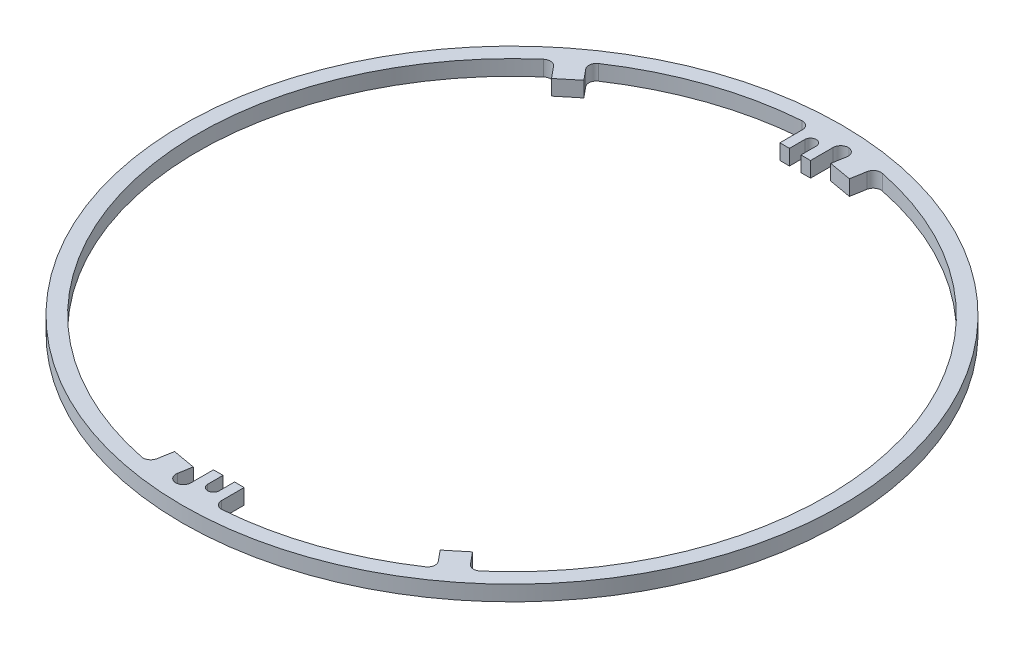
ISO-10303-21;
HEADER;
FILE_DESCRIPTION(('STEP AP214'),'2;1');
FILE_NAME('part.step','',(''),(''),'','','');
FILE_SCHEMA(('AUTOMOTIVE_DESIGN { 1 0 10303 214 1 1 1 1 }'));
ENDSEC;
DATA;
#1=APPLICATION_CONTEXT('core data for automotive mechanical design processes');
#2=APPLICATION_PROTOCOL_DEFINITION('international standard','automotive_design',2000,#1);
#3=PRODUCT_CONTEXT('',#1,'mechanical');
#4=PRODUCT('Part','Part','',(#3));
#5=PRODUCT_RELATED_PRODUCT_CATEGORY('part','',(#4));
#6=PRODUCT_DEFINITION_FORMATION('','',#4);
#7=PRODUCT_DEFINITION_CONTEXT('part definition',#1,'design');
#8=PRODUCT_DEFINITION('design','',#6,#7);
#9=PRODUCT_DEFINITION_SHAPE('','',#8);
#10=(LENGTH_UNIT() NAMED_UNIT(*) SI_UNIT(.MILLI.,.METRE.));
#11=(NAMED_UNIT(*) PLANE_ANGLE_UNIT() SI_UNIT($,.RADIAN.));
#12=(NAMED_UNIT(*) SI_UNIT($,.STERADIAN.) SOLID_ANGLE_UNIT());
#13=UNCERTAINTY_MEASURE_WITH_UNIT(LENGTH_MEASURE(1.E-05),#10,'distance_accuracy_value','');
#14=(GEOMETRIC_REPRESENTATION_CONTEXT(3) GLOBAL_UNCERTAINTY_ASSIGNED_CONTEXT((#13)) GLOBAL_UNIT_ASSIGNED_CONTEXT((#10,
#11,#12)) REPRESENTATION_CONTEXT('',''));
#15=CARTESIAN_POINT('',(0.,0.,0.));
#16=DIRECTION('',(0.,0.,1.));
#17=DIRECTION('',(1.,0.,0.));
#18=AXIS2_PLACEMENT_3D('',#15,#16,#17);
#19=CARTESIAN_POINT('',(0.,2.,0.));
#20=DIRECTION('',(0.,-1.,0.));
#21=DIRECTION('',(0.,0.,-1.));
#22=AXIS2_PLACEMENT_3D('',#19,#20,#21);
#23=CYLINDRICAL_SURFACE('',#22,41.);
#24=CARTESIAN_POINT('',(0.,2.,0.));
#25=DIRECTION('',(0.,1.,0.));
#26=DIRECTION('',(0.,0.,1.));
#27=AXIS2_PLACEMENT_3D('',#24,#25,#26);
#28=CIRCLE('',#27,41.);
#29=CARTESIAN_POINT('',(-3.075,2.,-40.8845248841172));
#30=VERTEX_POINT('',#29);
#31=CARTESIAN_POINT('',(-22.7848225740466,2.,-34.0859481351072));
#32=VERTEX_POINT('',#31);
#33=EDGE_CURVE('E491',#30,#32,#28,.T.);
#34=ORIENTED_EDGE('',*,*,#33,.T.);
#35=DIRECTION('',(0.,-1.,0.));
#36=VECTOR('',#35,1.);
#37=CARTESIAN_POINT('',(-22.7848225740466,2.,-34.0859481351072));
#38=LINE('',#37,#36);
#39=CARTESIAN_POINT('',(-22.7848225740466,0.,-34.0859481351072));
#40=VERTEX_POINT('',#39);
#41=EDGE_CURVE('E592',#32,#40,#38,.T.);
#42=ORIENTED_EDGE('',*,*,#41,.T.);
#43=CARTESIAN_POINT('',(0.,0.,0.));
#44=DIRECTION('',(0.,1.,0.));
#45=DIRECTION('',(0.,0.,1.));
#46=AXIS2_PLACEMENT_3D('',#43,#44,#45);
#47=CIRCLE('',#46,41.);
#48=CARTESIAN_POINT('',(-3.075,0.,-40.8845248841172));
#49=VERTEX_POINT('',#48);
#50=EDGE_CURVE('E497',#49,#40,#47,.T.);
#51=ORIENTED_EDGE('',*,*,#50,.F.);
#52=DIRECTION('',(0.,-1.,0.));
#53=VECTOR('',#52,1.);
#54=CARTESIAN_POINT('',(-3.075,2.,-40.8845248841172));
#55=LINE('',#54,#53);
#56=EDGE_CURVE('E509',#49,#30,#55,.F.);
#57=ORIENTED_EDGE('',*,*,#56,.T.);
#58=EDGE_LOOP('',(#34,#42,#51,#57));
#59=FACE_BOUND('',#58,.T.);
#60=ADVANCED_FACE('F36',(#59),#23,.F.);
#61=CARTESIAN_POINT('',(3.075,2.,40.8845248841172));
#62=VERTEX_POINT('',#61);
#63=CARTESIAN_POINT('',(22.7848225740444,2.,34.0859481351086));
#64=VERTEX_POINT('',#63);
#65=EDGE_CURVE('E486',#62,#64,#28,.T.);
#66=ORIENTED_EDGE('',*,*,#65,.T.);
#67=DIRECTION('',(0.,-1.,0.));
#68=VECTOR('',#67,1.);
#69=CARTESIAN_POINT('',(22.7848225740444,2.,34.0859481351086));
#70=LINE('',#69,#68);
#71=CARTESIAN_POINT('',(22.7848225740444,0.,34.0859481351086));
#72=VERTEX_POINT('',#71);
#73=EDGE_CURVE('E596',#64,#72,#70,.T.);
#74=ORIENTED_EDGE('',*,*,#73,.T.);
#75=CARTESIAN_POINT('',(3.075,0.,40.8845248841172));
#76=VERTEX_POINT('',#75);
#77=EDGE_CURVE('E492',#76,#72,#47,.T.);
#78=ORIENTED_EDGE('',*,*,#77,.F.);
#79=DIRECTION('',(0.,-1.,0.));
#80=VECTOR('',#79,1.);
#81=CARTESIAN_POINT('',(3.075,2.,40.8845248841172));
#82=LINE('',#81,#80);
#83=EDGE_CURVE('E523',#76,#62,#82,.F.);
#84=ORIENTED_EDGE('',*,*,#83,.T.);
#85=EDGE_LOOP('',(#66,#74,#78,#84));
#86=FACE_BOUND('',#85,.T.);
#87=ADVANCED_FACE('F624',(#86),#23,.F.);
#88=CARTESIAN_POINT('',(26.8619712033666,0.,30.9747397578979));
#89=VERTEX_POINT('',#88);
#90=CARTESIAN_POINT('',(8.12677801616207,0.,-40.186508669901));
#91=VERTEX_POINT('',#90);
#92=EDGE_CURVE('E496',#89,#91,#47,.T.);
#93=ORIENTED_EDGE('',*,*,#92,.F.);
#94=DIRECTION('',(0.,-1.,0.));
#95=VECTOR('',#94,1.);
#96=CARTESIAN_POINT('',(26.8619712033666,2.,30.9747397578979));
#97=LINE('',#96,#95);
#98=CARTESIAN_POINT('',(26.8619712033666,2.,30.9747397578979));
#99=VERTEX_POINT('',#98);
#100=EDGE_CURVE('E57',#89,#99,#97,.F.);
#101=ORIENTED_EDGE('',*,*,#100,.T.);
#102=CARTESIAN_POINT('',(8.12677801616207,2.,-40.186508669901));
#103=VERTEX_POINT('',#102);
#104=EDGE_CURVE('E490',#99,#103,#28,.T.);
#105=ORIENTED_EDGE('',*,*,#104,.T.);
#106=DIRECTION('',(0.,-1.,0.));
#107=VECTOR('',#106,1.);
#108=CARTESIAN_POINT('',(8.12677801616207,2.,-40.186508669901));
#109=LINE('',#108,#107);
#110=EDGE_CURVE('E573',#103,#91,#109,.T.);
#111=ORIENTED_EDGE('',*,*,#110,.T.);
#112=EDGE_LOOP('',(#93,#101,#105,#111));
#113=FACE_BOUND('',#112,.T.);
#114=ADVANCED_FACE('F723',(#113),#23,.F.);
#115=CARTESIAN_POINT('',(-26.8619712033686,0.,-30.9747397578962));
#116=VERTEX_POINT('',#115);
#117=CARTESIAN_POINT('',(-8.12677801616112,0.,40.1865086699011));
#118=VERTEX_POINT('',#117);
#119=EDGE_CURVE('E469',#116,#118,#47,.T.);
#120=ORIENTED_EDGE('',*,*,#119,.F.);
#121=DIRECTION('',(0.,-1.,0.));
#122=VECTOR('',#121,1.);
#123=CARTESIAN_POINT('',(-26.8619712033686,2.,-30.9747397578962));
#124=LINE('',#123,#122);
#125=CARTESIAN_POINT('',(-26.8619712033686,2.,-30.9747397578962));
#126=VERTEX_POINT('',#125);
#127=EDGE_CURVE('E590',#116,#126,#124,.F.);
#128=ORIENTED_EDGE('',*,*,#127,.T.);
#129=CARTESIAN_POINT('',(-8.12677801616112,2.,40.1865086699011));
#130=VERTEX_POINT('',#129);
#131=EDGE_CURVE('E495',#126,#130,#28,.T.);
#132=ORIENTED_EDGE('',*,*,#131,.T.);
#133=DIRECTION('',(0.,-1.,0.));
#134=VECTOR('',#133,1.);
#135=CARTESIAN_POINT('',(-8.12677801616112,2.,40.1865086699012));
#136=LINE('',#135,#134);
#137=EDGE_CURVE('E558',#130,#118,#136,.T.);
#138=ORIENTED_EDGE('',*,*,#137,.T.);
#139=EDGE_LOOP('',(#120,#128,#132,#138));
#140=FACE_BOUND('',#139,.T.);
#141=ADVANCED_FACE('F648',(#140),#23,.F.);
#142=CARTESIAN_POINT('',(0.,-5.69147245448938,36.9511904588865));
#143=DIRECTION('',(0.,0.,1.));
#144=DIRECTION('',(1.,0.,0.));
#145=AXIS2_PLACEMENT_3D('',#142,#143,#144);
#146=PLANE('',#145);
#147=DIRECTION('',(1.,0.,0.));
#148=VECTOR('',#147,1.);
#149=CARTESIAN_POINT('',(0.,2.,36.9511904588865));
#150=LINE('',#149,#148);
#151=CARTESIAN_POINT('',(-2.,2.,36.9511904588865));
#152=VERTEX_POINT('',#151);
#153=CARTESIAN_POINT('',(-0.75,2.,36.9511904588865));
#154=VERTEX_POINT('',#153);
#155=EDGE_CURVE('E470',#152,#154,#150,.T.);
#156=ORIENTED_EDGE('',*,*,#155,.T.);
#157=DIRECTION('',(0.,-1.,0.));
#158=VECTOR('',#157,1.);
#159=CARTESIAN_POINT('',(-0.75,-5.69147245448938,36.9511904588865));
#160=LINE('',#159,#158);
#161=CARTESIAN_POINT('',(-0.75,0.,36.9511904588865));
#162=VERTEX_POINT('',#161);
#163=EDGE_CURVE('E550',#154,#162,#160,.T.);
#164=ORIENTED_EDGE('',*,*,#163,.T.);
#165=DIRECTION('',(-1.,0.,0.));
#166=VECTOR('',#165,1.);
#167=CARTESIAN_POINT('',(0.,0.,36.9511904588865));
#168=LINE('',#167,#166);
#169=CARTESIAN_POINT('',(-2.,0.,36.9511904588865));
#170=VERTEX_POINT('',#169);
#171=EDGE_CURVE('E464',#162,#170,#168,.T.);
#172=ORIENTED_EDGE('',*,*,#171,.T.);
#173=DIRECTION('',(0.,1.,0.));
#174=VECTOR('',#173,1.);
#175=CARTESIAN_POINT('',(-2.,-5.69147245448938,36.9511904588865));
#176=LINE('',#175,#174);
#177=EDGE_CURVE('E478',#170,#152,#176,.T.);
#178=ORIENTED_EDGE('',*,*,#177,.T.);
#179=EDGE_LOOP('',(#156,#164,#172,#178));
#180=FACE_BOUND('',#179,.T.);
#181=ADVANCED_FACE('F687',(#180),#146,.F.);
#182=CARTESIAN_POINT('',(0.,-5.69147245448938,-38.9511904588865));
#183=DIRECTION('',(0.,1.,0.));
#184=DIRECTION('',(0.,0.,1.));
#185=AXIS2_PLACEMENT_3D('',#182,#183,#184);
#186=CYLINDRICAL_SURFACE('',#185,0.750000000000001);
#187=DIRECTION('',(0.,1.,0.));
#188=VECTOR('',#187,1.);
#189=CARTESIAN_POINT('',(0.75,0.,-38.9511904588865));
#190=LINE('',#189,#188);
#191=CARTESIAN_POINT('',(0.75,0.,-38.9511904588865));
#192=VERTEX_POINT('',#191);
#193=CARTESIAN_POINT('',(0.75,2.,-38.9511904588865));
#194=VERTEX_POINT('',#193);
#195=EDGE_CURVE('E406',#192,#194,#190,.T.);
#196=ORIENTED_EDGE('',*,*,#195,.T.);
#197=CARTESIAN_POINT('',(0.,2.,-38.9511904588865));
#198=DIRECTION('',(0.,1.,0.));
#199=DIRECTION('',(0.,0.,1.));
#200=AXIS2_PLACEMENT_3D('',#197,#198,#199);
#201=CIRCLE('',#200,0.750000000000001);
#202=CARTESIAN_POINT('',(-0.75,2.,-38.9511904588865));
#203=VERTEX_POINT('',#202);
#204=EDGE_CURVE('E409',#194,#203,#201,.T.);
#205=ORIENTED_EDGE('',*,*,#204,.T.);
#206=DIRECTION('',(0.,1.,0.));
#207=VECTOR('',#206,1.);
#208=CARTESIAN_POINT('',(-0.75,0.,-38.9511904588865));
#209=LINE('',#208,#207);
#210=CARTESIAN_POINT('',(-0.75,0.,-38.9511904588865));
#211=VERTEX_POINT('',#210);
#212=EDGE_CURVE('E401',#211,#203,#209,.T.);
#213=ORIENTED_EDGE('',*,*,#212,.F.);
#214=CARTESIAN_POINT('',(0.,0.,-38.9511904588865));
#215=DIRECTION('',(0.,1.,0.));
#216=DIRECTION('',(0.,0.,1.));
#217=AXIS2_PLACEMENT_3D('',#214,#215,#216);
#218=CIRCLE('',#217,0.750000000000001);
#219=EDGE_CURVE('E441',#211,#192,#218,.F.);
#220=ORIENTED_EDGE('',*,*,#219,.T.);
#221=EDGE_LOOP('',(#196,#205,#213,#220));
#222=FACE_BOUND('',#221,.T.);
#223=ADVANCED_FACE('F759',(#222),#186,.F.);
#224=CARTESIAN_POINT('',(0.,-5.69147245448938,-36.9511904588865));
#225=DIRECTION('',(0.,0.,1.));
#226=DIRECTION('',(1.,0.,0.));
#227=AXIS2_PLACEMENT_3D('',#224,#225,#226);
#228=PLANE('',#227);
#229=DIRECTION('',(0.,1.,0.));
#230=VECTOR('',#229,1.);
#231=CARTESIAN_POINT('',(0.75,-5.69147245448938,-36.9511904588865));
#232=LINE('',#231,#230);
#233=CARTESIAN_POINT('',(0.75,0.,-36.9511904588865));
#234=VERTEX_POINT('',#233);
#235=CARTESIAN_POINT('',(0.75,2.,-36.9511904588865));
#236=VERTEX_POINT('',#235);
#237=EDGE_CURVE('E545',#234,#236,#232,.T.);
#238=ORIENTED_EDGE('',*,*,#237,.F.);
#239=DIRECTION('',(-1.,0.,0.));
#240=VECTOR('',#239,1.);
#241=CARTESIAN_POINT('',(0.,0.,-36.9511904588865));
#242=LINE('',#241,#240);
#243=CARTESIAN_POINT('',(2.,0.,-36.9511904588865));
#244=VERTEX_POINT('',#243);
#245=EDGE_CURVE('E435',#244,#234,#242,.T.);
#246=ORIENTED_EDGE('',*,*,#245,.F.);
#247=DIRECTION('',(0.,1.,0.));
#248=VECTOR('',#247,1.);
#249=CARTESIAN_POINT('',(2.,-5.69147245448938,-36.9511904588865));
#250=LINE('',#249,#248);
#251=CARTESIAN_POINT('',(2.,2.,-36.9511904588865));
#252=VERTEX_POINT('',#251);
#253=EDGE_CURVE('E434',#244,#252,#250,.T.);
#254=ORIENTED_EDGE('',*,*,#253,.T.);
#255=DIRECTION('',(1.,0.,0.));
#256=VECTOR('',#255,1.);
#257=CARTESIAN_POINT('',(0.,2.,-36.9511904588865));
#258=LINE('',#257,#256);
#259=EDGE_CURVE('E452',#236,#252,#258,.T.);
#260=ORIENTED_EDGE('',*,*,#259,.F.);
#261=EDGE_LOOP('',(#238,#246,#254,#260));
#262=FACE_BOUND('',#261,.T.);
#263=ADVANCED_FACE('F766',(#262),#228,.T.);
#264=CARTESIAN_POINT('',(0.,2.,0.));
#265=DIRECTION('',(0.,1.,0.));
#266=DIRECTION('',(0.,0.,1.));
#267=AXIS2_PLACEMENT_3D('',#264,#265,#266);
#268=PLANE('',#267);
#269=DIRECTION('',(0.,0.,-1.));
#270=VECTOR('',#269,1.);
#271=CARTESIAN_POINT('',(0.75,2.,-35.9511904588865));
#272=LINE('',#271,#270);
#273=EDGE_CURVE('E398',#236,#194,#272,.T.);
#274=ORIENTED_EDGE('',*,*,#273,.F.);
#275=ORIENTED_EDGE('',*,*,#259,.T.);
#276=DIRECTION('',(0.,0.,1.));
#277=VECTOR('',#276,1.);
#278=CARTESIAN_POINT('',(1.99999999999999,2.,0.));
#279=LINE('',#278,#277);
#280=CARTESIAN_POINT('',(2.,2.,-39.8873413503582));
#281=VERTEX_POINT('',#280);
#282=EDGE_CURVE('E447',#281,#252,#279,.T.);
#283=ORIENTED_EDGE('',*,*,#282,.F.);
#284=CARTESIAN_POINT('',(3.,2.,-39.8873413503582));
#285=DIRECTION('',(0.,1.,0.));
#286=DIRECTION('',(0.,0.,1.));
#287=AXIS2_PLACEMENT_3D('',#284,#285,#286);
#288=CIRCLE('',#287,1.);
#289=CARTESIAN_POINT('',(3.075,2.,-40.8845248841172));
#290=VERTEX_POINT('',#289);
#291=EDGE_CURVE('E514',#281,#290,#288,.F.);
#292=ORIENTED_EDGE('',*,*,#291,.T.);
#293=CARTESIAN_POINT('',(2.97195013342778,2.,-39.8898486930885));
#294=DIRECTION('',(0.,1.,0.));
#295=DIRECTION('',(0.,0.,1.));
#296=AXIS2_PLACEMENT_3D('',#293,#294,#295);
#297=CIRCLE('',#296,1.);
#298=CARTESIAN_POINT('',(3.95675788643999,2.,-39.7162005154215));
#299=VERTEX_POINT('',#298);
#300=EDGE_CURVE('E583',#290,#299,#297,.F.);
#301=ORIENTED_EDGE('',*,*,#300,.T.);
#302=DIRECTION('',(-0.173648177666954,0.,0.984807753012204));
#303=VECTOR('',#302,1.);
#304=CARTESIAN_POINT('',(3.64420749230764,2.,-37.9436391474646));
#305=LINE('',#304,#303);
#306=CARTESIAN_POINT('',(3.64420749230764,2.,-37.9436391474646));
#307=VERTEX_POINT('',#306);
#308=EDGE_CURVE('E346',#299,#307,#305,.T.);
#309=ORIENTED_EDGE('',*,*,#308,.T.);
#310=DIRECTION('',(0.984807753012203,0.,0.173648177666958));
#311=VECTOR('',#310,1.);
#312=CARTESIAN_POINT('',(6.59863075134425,2.,-37.4226946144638));
#313=LINE('',#312,#311);
#314=CARTESIAN_POINT('',(6.59863075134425,2.,-37.4226946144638));
#315=VERTEX_POINT('',#314);
#316=EDGE_CURVE('E361',#307,#315,#313,.T.);
#317=ORIENTED_EDGE('',*,*,#316,.T.);
#318=DIRECTION('',(0.173648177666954,0.,-0.984807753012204));
#319=VECTOR('',#318,1.);
#320=CARTESIAN_POINT('',(7.11957528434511,2.,-40.3771178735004));
#321=LINE('',#320,#319);
#322=CARTESIAN_POINT('',(6.94375616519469,2.,-39.3799980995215));
#323=VERTEX_POINT('',#322);
#324=EDGE_CURVE('E364',#315,#323,#321,.T.);
#325=ORIENTED_EDGE('',*,*,#324,.T.);
#326=CARTESIAN_POINT('',(7.9285639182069,2.,-39.2063499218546));
#327=DIRECTION('',(0.,1.,0.));
#328=DIRECTION('',(0.,0.,1.));
#329=AXIS2_PLACEMENT_3D('',#326,#327,#328);
#330=CIRCLE('',#329,1.);
#331=EDGE_CURVE('E578',#323,#103,#330,.F.);
#332=ORIENTED_EDGE('',*,*,#331,.T.);
#333=ORIENTED_EDGE('',*,*,#104,.F.);
#334=CARTESIAN_POINT('',(26.2068011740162,2.,30.2192583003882));
#335=DIRECTION('',(0.,1.,0.));
#336=DIRECTION('',(0.,0.,1.));
#337=AXIS2_PLACEMENT_3D('',#334,#335,#336);
#338=CIRCLE('',#337,1.);
#339=CARTESIAN_POINT('',(25.4351765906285,2.,30.855336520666));
#340=VERTEX_POINT('',#339);
#341=EDGE_CURVE('E11',#99,#340,#338,.F.);
#342=ORIENTED_EDGE('',*,*,#341,.T.);
#343=DIRECTION('',(0.636078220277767,0.,0.771624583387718));
#344=VECTOR('',#343,1.);
#345=CARTESIAN_POINT('',(26.0792070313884,2.,31.6366079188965));
#346=LINE('',#345,#344);
#347=CARTESIAN_POINT('',(24.1709723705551,2.,29.3217341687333));
#348=VERTEX_POINT('',#347);
#349=EDGE_CURVE('E343',#348,#340,#346,.T.);
#350=ORIENTED_EDGE('',*,*,#349,.F.);
#351=DIRECTION('',(0.771624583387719,0.,-0.636078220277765));
#352=VECTOR('',#351,1.);
#353=CARTESIAN_POINT('',(24.1709723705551,2.,29.3217341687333));
#354=LINE('',#353,#352);
#355=CARTESIAN_POINT('',(21.8560986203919,2.,31.2299688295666));
#356=VERTEX_POINT('',#355);
#357=EDGE_CURVE('E348',#356,#348,#354,.T.);
#358=ORIENTED_EDGE('',*,*,#357,.F.);
#359=DIRECTION('',(-0.636078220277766,0.,-0.771624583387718));
#360=VECTOR('',#359,1.);
#361=CARTESIAN_POINT('',(21.8560986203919,2.,31.2299688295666));
#362=LINE('',#361,#360);
#363=CARTESIAN_POINT('',(23.0007197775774,2.,32.6185053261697));
#364=VERTEX_POINT('',#363);
#365=EDGE_CURVE('E335',#364,#356,#362,.T.);
#366=ORIENTED_EDGE('',*,*,#365,.F.);
#367=CARTESIAN_POINT('',(22.2290951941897,2.,33.2545835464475));
#368=DIRECTION('',(0.,1.,0.));
#369=DIRECTION('',(0.,0.,1.));
#370=AXIS2_PLACEMENT_3D('',#367,#368,#369);
#371=CIRCLE('',#370,1.);
#372=EDGE_CURVE('E615',#364,#64,#371,.F.);
#373=ORIENTED_EDGE('',*,*,#372,.T.);
#374=ORIENTED_EDGE('',*,*,#65,.F.);
#375=CARTESIAN_POINT('',(3.,2.,39.8873413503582));
#376=DIRECTION('',(0.,1.,0.));
#377=DIRECTION('',(0.,0.,1.));
#378=AXIS2_PLACEMENT_3D('',#375,#376,#377);
#379=CIRCLE('',#378,1.);
#380=CARTESIAN_POINT('',(2.,2.,39.8873413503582));
#381=VERTEX_POINT('',#380);
#382=EDGE_CURVE('E534',#62,#381,#379,.F.);
#383=ORIENTED_EDGE('',*,*,#382,.T.);
#384=DIRECTION('',(0.,0.,-1.));
#385=VECTOR('',#384,1.);
#386=CARTESIAN_POINT('',(1.99999999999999,2.,0.));
#387=LINE('',#386,#385);
#388=CARTESIAN_POINT('',(2.,2.,36.9511904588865));
#389=VERTEX_POINT('',#388);
#390=EDGE_CURVE('E475',#381,#389,#387,.T.);
#391=ORIENTED_EDGE('',*,*,#390,.T.);
#392=CARTESIAN_POINT('',(0.75,2.,36.9511904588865));
#393=VERTEX_POINT('',#392);
#394=EDGE_CURVE('E444',#393,#389,#150,.T.);
#395=ORIENTED_EDGE('',*,*,#394,.F.);
#396=DIRECTION('',(0.,0.,-1.));
#397=VECTOR('',#396,1.);
#398=CARTESIAN_POINT('',(0.75,2.,35.9511904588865));
#399=LINE('',#398,#397);
#400=CARTESIAN_POINT('',(0.75,2.,38.9511904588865));
#401=VERTEX_POINT('',#400);
#402=EDGE_CURVE('E424',#401,#393,#399,.T.);
#403=ORIENTED_EDGE('',*,*,#402,.F.);
#404=CARTESIAN_POINT('',(0.,2.,38.9511904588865));
#405=DIRECTION('',(0.,1.,0.));
#406=DIRECTION('',(0.,0.,-1.));
#407=AXIS2_PLACEMENT_3D('',#404,#405,#406);
#408=CIRCLE('',#407,0.75);
#409=CARTESIAN_POINT('',(-0.75,2.,38.9511904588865));
#410=VERTEX_POINT('',#409);
#411=EDGE_CURVE('E393',#410,#401,#408,.T.);
#412=ORIENTED_EDGE('',*,*,#411,.F.);
#413=DIRECTION('',(0.,0.,1.));
#414=VECTOR('',#413,1.);
#415=CARTESIAN_POINT('',(-0.75,2.,38.9511904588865));
#416=LINE('',#415,#414);
#417=EDGE_CURVE('E415',#154,#410,#416,.T.);
#418=ORIENTED_EDGE('',*,*,#417,.F.);
#419=ORIENTED_EDGE('',*,*,#155,.F.);
#420=DIRECTION('',(0.,0.,-1.));
#421=VECTOR('',#420,1.);
#422=CARTESIAN_POINT('',(-1.99999999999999,2.,0.));
#423=LINE('',#422,#421);
#424=CARTESIAN_POINT('',(-2.,2.,39.8873413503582));
#425=VERTEX_POINT('',#424);
#426=EDGE_CURVE('E473',#425,#152,#423,.T.);
#427=ORIENTED_EDGE('',*,*,#426,.F.);
#428=CARTESIAN_POINT('',(-3.,2.,39.8873413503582));
#429=DIRECTION('',(0.,1.,0.));
#430=DIRECTION('',(0.,0.,1.));
#431=AXIS2_PLACEMENT_3D('',#428,#429,#430);
#432=CIRCLE('',#431,1.);
#433=CARTESIAN_POINT('',(-3.075,2.,40.8845248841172));
#434=VERTEX_POINT('',#433);
#435=EDGE_CURVE('E538',#425,#434,#432,.F.);
#436=ORIENTED_EDGE('',*,*,#435,.T.);
#437=CARTESIAN_POINT('',(-2.97195013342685,2.,39.8898486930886));
#438=DIRECTION('',(0.,1.,0.));
#439=DIRECTION('',(0.,0.,1.));
#440=AXIS2_PLACEMENT_3D('',#437,#438,#439);
#441=CIRCLE('',#440,1.);
#442=CARTESIAN_POINT('',(-3.95675788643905,2.,39.7162005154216));
#443=VERTEX_POINT('',#442);
#444=EDGE_CURVE('E561',#434,#443,#441,.F.);
#445=ORIENTED_EDGE('',*,*,#444,.T.);
#446=DIRECTION('',(0.17364817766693,0.,-0.984807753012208));
#447=VECTOR('',#446,1.);
#448=CARTESIAN_POINT('',(-3.64420749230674,2.,37.9436391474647));
#449=LINE('',#448,#447);
#450=CARTESIAN_POINT('',(-3.64420749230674,2.,37.9436391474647));
#451=VERTEX_POINT('',#450);
#452=EDGE_CURVE('E373',#443,#451,#449,.T.);
#453=ORIENTED_EDGE('',*,*,#452,.T.);
#454=DIRECTION('',(-0.984807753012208,0.,-0.173648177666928));
#455=VECTOR('',#454,1.);
#456=CARTESIAN_POINT('',(-6.59863075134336,2.,37.4226946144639));
#457=LINE('',#456,#455);
#458=CARTESIAN_POINT('',(-6.59863075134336,2.,37.4226946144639));
#459=VERTEX_POINT('',#458);
#460=EDGE_CURVE('E381',#451,#459,#457,.T.);
#461=ORIENTED_EDGE('',*,*,#460,.T.);
#462=DIRECTION('',(-0.173648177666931,0.,0.984807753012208));
#463=VECTOR('',#462,1.);
#464=CARTESIAN_POINT('',(-7.11957528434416,2.,40.3771178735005));
#465=LINE('',#464,#463);
#466=CARTESIAN_POINT('',(-6.94375616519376,2.,39.3799980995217));
#467=VERTEX_POINT('',#466);
#468=EDGE_CURVE('E384',#459,#467,#465,.T.);
#469=ORIENTED_EDGE('',*,*,#468,.T.);
#470=CARTESIAN_POINT('',(-7.92856391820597,2.,39.2063499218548));
#471=DIRECTION('',(0.,1.,0.));
#472=DIRECTION('',(0.,0.,1.));
#473=AXIS2_PLACEMENT_3D('',#470,#471,#472);
#474=CIRCLE('',#473,1.);
#475=EDGE_CURVE('E565',#467,#130,#474,.F.);
#476=ORIENTED_EDGE('',*,*,#475,.T.);
#477=ORIENTED_EDGE('',*,*,#131,.F.);
#478=CARTESIAN_POINT('',(-26.2068011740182,2.,-30.2192583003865));
#479=DIRECTION('',(0.,1.,0.));
#480=DIRECTION('',(0.,0.,1.));
#481=AXIS2_PLACEMENT_3D('',#478,#479,#480);
#482=CIRCLE('',#481,1.);
#483=CARTESIAN_POINT('',(-25.4351765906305,2.,-30.8553365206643));
#484=VERTEX_POINT('',#483);
#485=EDGE_CURVE('E607',#126,#484,#482,.F.);
#486=ORIENTED_EDGE('',*,*,#485,.T.);
#487=DIRECTION('',(-0.636078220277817,0.,-0.771624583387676));
#488=VECTOR('',#487,1.);
#489=CARTESIAN_POINT('',(-26.0792070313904,2.,-31.6366079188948));
#490=LINE('',#489,#488);
#491=CARTESIAN_POINT('',(-24.170972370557,2.,-29.3217341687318));
#492=VERTEX_POINT('',#491);
#493=EDGE_CURVE('E322',#492,#484,#490,.T.);
#494=ORIENTED_EDGE('',*,*,#493,.F.);
#495=DIRECTION('',(-0.771624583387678,0.,0.636078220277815));
#496=VECTOR('',#495,1.);
#497=CARTESIAN_POINT('',(-24.170972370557,2.,-29.3217341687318));
#498=LINE('',#497,#496);
#499=CARTESIAN_POINT('',(-21.8560986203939,2.,-31.2299688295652));
#500=VERTEX_POINT('',#499);
#501=EDGE_CURVE('E317',#500,#492,#498,.T.);
#502=ORIENTED_EDGE('',*,*,#501,.F.);
#503=DIRECTION('',(0.636078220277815,0.,0.771624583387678));
#504=VECTOR('',#503,1.);
#505=CARTESIAN_POINT('',(-21.8560986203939,2.,-31.2299688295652));
#506=LINE('',#505,#504);
#507=CARTESIAN_POINT('',(-23.0007197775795,2.,-32.6185053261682));
#508=VERTEX_POINT('',#507);
#509=EDGE_CURVE('E303',#508,#500,#506,.T.);
#510=ORIENTED_EDGE('',*,*,#509,.F.);
#511=CARTESIAN_POINT('',(-22.2290951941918,2.,-33.254583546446));
#512=DIRECTION('',(0.,1.,0.));
#513=DIRECTION('',(0.,0.,1.));
#514=AXIS2_PLACEMENT_3D('',#511,#512,#513);
#515=CIRCLE('',#514,1.);
#516=EDGE_CURVE('E611',#508,#32,#515,.F.);
#517=ORIENTED_EDGE('',*,*,#516,.T.);
#518=ORIENTED_EDGE('',*,*,#33,.F.);
#519=CARTESIAN_POINT('',(-3.,2.,-39.8873413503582));
#520=DIRECTION('',(0.,1.,0.));
#521=DIRECTION('',(0.,0.,1.));
#522=AXIS2_PLACEMENT_3D('',#519,#520,#521);
#523=CIRCLE('',#522,1.);
#524=CARTESIAN_POINT('',(-2.,2.,-39.8873413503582));
#525=VERTEX_POINT('',#524);
#526=EDGE_CURVE('E519',#30,#525,#523,.F.);
#527=ORIENTED_EDGE('',*,*,#526,.T.);
#528=DIRECTION('',(0.,0.,1.));
#529=VECTOR('',#528,1.);
#530=CARTESIAN_POINT('',(-1.99999999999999,2.,0.));
#531=LINE('',#530,#529);
#532=CARTESIAN_POINT('',(-2.,2.,-36.9511904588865));
#533=VERTEX_POINT('',#532);
#534=EDGE_CURVE('E450',#525,#533,#531,.T.);
#535=ORIENTED_EDGE('',*,*,#534,.T.);
#536=CARTESIAN_POINT('',(-0.75,2.,-36.9511904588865));
#537=VERTEX_POINT('',#536);
#538=EDGE_CURVE('E453',#533,#537,#258,.T.);
#539=ORIENTED_EDGE('',*,*,#538,.T.);
#540=DIRECTION('',(0.,0.,1.));
#541=VECTOR('',#540,1.);
#542=CARTESIAN_POINT('',(-0.75,2.,-38.9511904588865));
#543=LINE('',#542,#541);
#544=EDGE_CURVE('E402',#203,#537,#543,.T.);
#545=ORIENTED_EDGE('',*,*,#544,.F.);
#546=ORIENTED_EDGE('',*,*,#204,.F.);
#547=EDGE_LOOP('',(#274,#275,#283,#292,#301,#309,#317,#325,#332,#333,#342,#350,#358,#366,#373,
#374,#383,#391,#395,#403,#412,#418,#419,#427,#436,#445,#453,#461,#469,#476,#477,#486,#494,#502,
#510,#517,#518,#527,#535,#539,#545,#546));
#548=FACE_BOUND('',#547,.T.);
#549=CARTESIAN_POINT('',(0.,2.,0.));
#550=DIRECTION('',(0.,1.,0.));
#551=DIRECTION('',(0.,0.,1.));
#552=AXIS2_PLACEMENT_3D('',#549,#550,#551);
#553=CIRCLE('',#552,43.);
#554=CARTESIAN_POINT('',(0.,2.,43.));
#555=VERTEX_POINT('',#554);
#556=EDGE_CURVE('E498',#555,#555,#553,.T.);
#557=ORIENTED_EDGE('',*,*,#556,.T.);
#558=EDGE_LOOP('',(#557));
#559=FACE_BOUND('',#558,.T.);
#560=ADVANCED_FACE('F319',(#548,#559),#268,.T.);
#561=CARTESIAN_POINT('',(0.,0.,0.));
#562=DIRECTION('',(0.,1.,0.));
#563=DIRECTION('',(0.,0.,1.));
#564=AXIS2_PLACEMENT_3D('',#561,#562,#563);
#565=PLANE('',#564);
#566=CARTESIAN_POINT('',(0.,0.,0.));
#567=DIRECTION('',(0.,1.,0.));
#568=DIRECTION('',(0.,0.,1.));
#569=AXIS2_PLACEMENT_3D('',#566,#567,#568);
#570=CIRCLE('',#569,43.);
#571=CARTESIAN_POINT('',(0.,0.,43.));
#572=VERTEX_POINT('',#571);
#573=EDGE_CURVE('E489',#572,#572,#570,.T.);
#574=ORIENTED_EDGE('',*,*,#573,.F.);
#575=EDGE_LOOP('',(#574));
#576=FACE_BOUND('',#575,.T.);
#577=ORIENTED_EDGE('',*,*,#245,.T.);
#578=DIRECTION('',(0.,0.,-1.));
#579=VECTOR('',#578,1.);
#580=CARTESIAN_POINT('',(0.75,0.,-35.9511904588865));
#581=LINE('',#580,#579);
#582=EDGE_CURVE('E397',#234,#192,#581,.T.);
#583=ORIENTED_EDGE('',*,*,#582,.T.);
#584=ORIENTED_EDGE('',*,*,#219,.F.);
#585=DIRECTION('',(0.,0.,1.));
#586=VECTOR('',#585,1.);
#587=CARTESIAN_POINT('',(-0.75,0.,-38.9511904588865));
#588=LINE('',#587,#586);
#589=CARTESIAN_POINT('',(-0.75,0.,-36.9511904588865));
#590=VERTEX_POINT('',#589);
#591=EDGE_CURVE('E394',#211,#590,#588,.T.);
#592=ORIENTED_EDGE('',*,*,#591,.T.);
#593=CARTESIAN_POINT('',(-2.,0.,-36.9511904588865));
#594=VERTEX_POINT('',#593);
#595=EDGE_CURVE('E433',#590,#594,#242,.T.);
#596=ORIENTED_EDGE('',*,*,#595,.T.);
#597=DIRECTION('',(0.,0.,-1.));
#598=VECTOR('',#597,1.);
#599=CARTESIAN_POINT('',(-1.99999999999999,0.,0.));
#600=LINE('',#599,#598);
#601=CARTESIAN_POINT('',(-2.,0.,-39.8873413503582));
#602=VERTEX_POINT('',#601);
#603=EDGE_CURVE('E430',#594,#602,#600,.T.);
#604=ORIENTED_EDGE('',*,*,#603,.T.);
#605=CARTESIAN_POINT('',(-3.,0.,-39.8873413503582));
#606=DIRECTION('',(0.,1.,0.));
#607=DIRECTION('',(0.,0.,1.));
#608=AXIS2_PLACEMENT_3D('',#605,#606,#607);
#609=CIRCLE('',#608,1.);
#610=EDGE_CURVE('E521',#602,#49,#609,.T.);
#611=ORIENTED_EDGE('',*,*,#610,.T.);
#612=ORIENTED_EDGE('',*,*,#50,.T.);
#613=CARTESIAN_POINT('',(-22.2290951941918,0.,-33.254583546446));
#614=DIRECTION('',(0.,1.,0.));
#615=DIRECTION('',(0.,0.,1.));
#616=AXIS2_PLACEMENT_3D('',#613,#614,#615);
#617=CIRCLE('',#616,1.);
#618=CARTESIAN_POINT('',(-23.0007197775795,0.,-32.6185053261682));
#619=VERTEX_POINT('',#618);
#620=EDGE_CURVE('E609',#40,#619,#617,.T.);
#621=ORIENTED_EDGE('',*,*,#620,.T.);
#622=DIRECTION('',(0.636078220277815,0.,0.771624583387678));
#623=VECTOR('',#622,1.);
#624=CARTESIAN_POINT('',(-21.8560986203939,0.,-31.2299688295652));
#625=LINE('',#624,#623);
#626=CARTESIAN_POINT('',(-21.8560986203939,0.,-31.2299688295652));
#627=VERTEX_POINT('',#626);
#628=EDGE_CURVE('E1184',#619,#627,#625,.T.);
#629=ORIENTED_EDGE('',*,*,#628,.T.);
#630=DIRECTION('',(-0.771624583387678,0.,0.636078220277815));
#631=VECTOR('',#630,1.);
#632=CARTESIAN_POINT('',(-24.170972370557,0.,-29.3217341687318));
#633=LINE('',#632,#631);
#634=CARTESIAN_POINT('',(-24.170972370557,0.,-29.3217341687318));
#635=VERTEX_POINT('',#634);
#636=EDGE_CURVE('E329',#627,#635,#633,.T.);
#637=ORIENTED_EDGE('',*,*,#636,.T.);
#638=DIRECTION('',(-0.636078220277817,0.,-0.771624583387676));
#639=VECTOR('',#638,1.);
#640=CARTESIAN_POINT('',(-26.0792070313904,0.,-31.6366079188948));
#641=LINE('',#640,#639);
#642=CARTESIAN_POINT('',(-25.4351765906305,0.,-30.8553365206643));
#643=VERTEX_POINT('',#642);
#644=EDGE_CURVE('E314',#635,#643,#641,.T.);
#645=ORIENTED_EDGE('',*,*,#644,.T.);
#646=CARTESIAN_POINT('',(-26.2068011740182,0.,-30.2192583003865));
#647=DIRECTION('',(0.,1.,0.));
#648=DIRECTION('',(0.,0.,1.));
#649=AXIS2_PLACEMENT_3D('',#646,#647,#648);
#650=CIRCLE('',#649,1.);
#651=EDGE_CURVE('E605',#643,#116,#650,.T.);
#652=ORIENTED_EDGE('',*,*,#651,.T.);
#653=ORIENTED_EDGE('',*,*,#119,.T.);
#654=CARTESIAN_POINT('',(-7.92856391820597,0.,39.2063499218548));
#655=DIRECTION('',(0.,1.,0.));
#656=DIRECTION('',(0.,0.,1.));
#657=AXIS2_PLACEMENT_3D('',#654,#655,#656);
#658=CIRCLE('',#657,1.);
#659=CARTESIAN_POINT('',(-6.94375616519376,0.,39.3799980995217));
#660=VERTEX_POINT('',#659);
#661=EDGE_CURVE('E568',#118,#660,#658,.T.);
#662=ORIENTED_EDGE('',*,*,#661,.T.);
#663=DIRECTION('',(0.173648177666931,0.,-0.984807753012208));
#664=VECTOR('',#663,1.);
#665=CARTESIAN_POINT('',(-7.11957528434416,0.,40.3771178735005));
#666=LINE('',#665,#664);
#667=CARTESIAN_POINT('',(-6.59863075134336,0.,37.4226946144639));
#668=VERTEX_POINT('',#667);
#669=EDGE_CURVE('E376',#660,#668,#666,.T.);
#670=ORIENTED_EDGE('',*,*,#669,.T.);
#671=DIRECTION('',(0.984807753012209,0.,0.173648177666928));
#672=VECTOR('',#671,1.);
#673=CARTESIAN_POINT('',(-6.59863075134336,0.,37.4226946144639));
#674=LINE('',#673,#672);
#675=CARTESIAN_POINT('',(-3.64420749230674,0.,37.9436391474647));
#676=VERTEX_POINT('',#675);
#677=EDGE_CURVE('E374',#668,#676,#674,.T.);
#678=ORIENTED_EDGE('',*,*,#677,.T.);
#679=DIRECTION('',(-0.17364817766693,0.,0.984807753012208));
#680=VECTOR('',#679,1.);
#681=CARTESIAN_POINT('',(-3.64420749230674,0.,37.9436391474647));
#682=LINE('',#681,#680);
#683=CARTESIAN_POINT('',(-3.95675788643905,0.,39.7162005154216));
#684=VERTEX_POINT('',#683);
#685=EDGE_CURVE('E379',#676,#684,#682,.T.);
#686=ORIENTED_EDGE('',*,*,#685,.T.);
#687=CARTESIAN_POINT('',(-2.97195013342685,0.,39.8898486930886));
#688=DIRECTION('',(0.,1.,0.));
#689=DIRECTION('',(0.,0.,1.));
#690=AXIS2_PLACEMENT_3D('',#687,#688,#689);
#691=CIRCLE('',#690,1.);
#692=CARTESIAN_POINT('',(-3.075,0.,40.8845248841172));
#693=VERTEX_POINT('',#692);
#694=EDGE_CURVE('E563',#684,#693,#691,.T.);
#695=ORIENTED_EDGE('',*,*,#694,.T.);
#696=CARTESIAN_POINT('',(-3.,0.,39.8873413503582));
#697=DIRECTION('',(0.,1.,0.));
#698=DIRECTION('',(0.,0.,1.));
#699=AXIS2_PLACEMENT_3D('',#696,#697,#698);
#700=CIRCLE('',#699,1.);
#701=CARTESIAN_POINT('',(-2.,0.,39.8873413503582));
#702=VERTEX_POINT('',#701);
#703=EDGE_CURVE('E541',#693,#702,#700,.T.);
#704=ORIENTED_EDGE('',*,*,#703,.T.);
#705=DIRECTION('',(0.,0.,1.));
#706=VECTOR('',#705,1.);
#707=CARTESIAN_POINT('',(-1.99999999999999,0.,0.));
#708=LINE('',#707,#706);
#709=EDGE_CURVE('E465',#170,#702,#708,.T.);
#710=ORIENTED_EDGE('',*,*,#709,.F.);
#711=ORIENTED_EDGE('',*,*,#171,.F.);
#712=DIRECTION('',(0.,0.,1.));
#713=VECTOR('',#712,1.);
#714=CARTESIAN_POINT('',(-0.75,0.,38.9511904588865));
#715=LINE('',#714,#713);
#716=CARTESIAN_POINT('',(-0.75,0.,38.9511904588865));
#717=VERTEX_POINT('',#716);
#718=EDGE_CURVE('E418',#162,#717,#715,.T.);
#719=ORIENTED_EDGE('',*,*,#718,.T.);
#720=CARTESIAN_POINT('',(0.,0.,38.9511904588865));
#721=DIRECTION('',(0.,1.,0.));
#722=DIRECTION('',(0.,0.,-1.));
#723=AXIS2_PLACEMENT_3D('',#720,#721,#722);
#724=CIRCLE('',#723,0.75);
#725=CARTESIAN_POINT('',(0.75,0.,38.9511904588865));
#726=VERTEX_POINT('',#725);
#727=EDGE_CURVE('E411',#717,#726,#724,.T.);
#728=ORIENTED_EDGE('',*,*,#727,.T.);
#729=DIRECTION('',(0.,0.,-1.));
#730=VECTOR('',#729,1.);
#731=CARTESIAN_POINT('',(0.75,0.,35.9511904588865));
#732=LINE('',#731,#730);
#733=CARTESIAN_POINT('',(0.75,0.,36.9511904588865));
#734=VERTEX_POINT('',#733);
#735=EDGE_CURVE('E414',#726,#734,#732,.T.);
#736=ORIENTED_EDGE('',*,*,#735,.T.);
#737=CARTESIAN_POINT('',(2.,0.,36.9511904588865));
#738=VERTEX_POINT('',#737);
#739=EDGE_CURVE('E466',#738,#734,#168,.T.);
#740=ORIENTED_EDGE('',*,*,#739,.F.);
#741=DIRECTION('',(0.,0.,1.));
#742=VECTOR('',#741,1.);
#743=CARTESIAN_POINT('',(1.99999999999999,0.,0.));
#744=LINE('',#743,#742);
#745=CARTESIAN_POINT('',(2.,0.,39.8873413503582));
#746=VERTEX_POINT('',#745);
#747=EDGE_CURVE('E461',#738,#746,#744,.T.);
#748=ORIENTED_EDGE('',*,*,#747,.T.);
#749=CARTESIAN_POINT('',(3.,0.,39.8873413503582));
#750=DIRECTION('',(0.,1.,0.));
#751=DIRECTION('',(0.,0.,1.));
#752=AXIS2_PLACEMENT_3D('',#749,#750,#751);
#753=CIRCLE('',#752,1.);
#754=EDGE_CURVE('E536',#746,#76,#753,.T.);
#755=ORIENTED_EDGE('',*,*,#754,.T.);
#756=ORIENTED_EDGE('',*,*,#77,.T.);
#757=CARTESIAN_POINT('',(22.2290951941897,0.,33.2545835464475));
#758=DIRECTION('',(0.,1.,0.));
#759=DIRECTION('',(0.,0.,1.));
#760=AXIS2_PLACEMENT_3D('',#757,#758,#759);
#761=CIRCLE('',#760,1.);
#762=CARTESIAN_POINT('',(23.0007197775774,0.,32.6185053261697));
#763=VERTEX_POINT('',#762);
#764=EDGE_CURVE('E613',#72,#763,#761,.T.);
#765=ORIENTED_EDGE('',*,*,#764,.T.);
#766=DIRECTION('',(-0.636078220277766,0.,-0.771624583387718));
#767=VECTOR('',#766,1.);
#768=CARTESIAN_POINT('',(21.8560986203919,0.,31.2299688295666));
#769=LINE('',#768,#767);
#770=CARTESIAN_POINT('',(21.8560986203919,0.,31.2299688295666));
#771=VERTEX_POINT('',#770);
#772=EDGE_CURVE('E339',#763,#771,#769,.T.);
#773=ORIENTED_EDGE('',*,*,#772,.T.);
#774=DIRECTION('',(0.771624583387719,0.,-0.636078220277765));
#775=VECTOR('',#774,1.);
#776=CARTESIAN_POINT('',(24.1709723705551,0.,29.3217341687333));
#777=LINE('',#776,#775);
#778=CARTESIAN_POINT('',(24.1709723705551,0.,29.3217341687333));
#779=VERTEX_POINT('',#778);
#780=EDGE_CURVE('E336',#771,#779,#777,.T.);
#781=ORIENTED_EDGE('',*,*,#780,.T.);
#782=DIRECTION('',(0.636078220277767,0.,0.771624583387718));
#783=VECTOR('',#782,1.);
#784=CARTESIAN_POINT('',(26.0792070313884,0.,31.6366079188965));
#785=LINE('',#784,#783);
#786=CARTESIAN_POINT('',(25.4351765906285,0.,30.855336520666));
#787=VERTEX_POINT('',#786);
#788=EDGE_CURVE('E333',#779,#787,#785,.T.);
#789=ORIENTED_EDGE('',*,*,#788,.T.);
#790=CARTESIAN_POINT('',(26.2068011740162,0.,30.2192583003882));
#791=DIRECTION('',(0.,1.,0.));
#792=DIRECTION('',(0.,0.,1.));
#793=AXIS2_PLACEMENT_3D('',#790,#791,#792);
#794=CIRCLE('',#793,1.);
#795=EDGE_CURVE('E44',#787,#89,#794,.T.);
#796=ORIENTED_EDGE('',*,*,#795,.T.);
#797=ORIENTED_EDGE('',*,*,#92,.T.);
#798=CARTESIAN_POINT('',(7.9285639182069,0.,-39.2063499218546));
#799=DIRECTION('',(0.,1.,0.));
#800=DIRECTION('',(0.,0.,1.));
#801=AXIS2_PLACEMENT_3D('',#798,#799,#800);
#802=CIRCLE('',#801,1.);
#803=CARTESIAN_POINT('',(6.94375616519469,0.,-39.3799980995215));
#804=VERTEX_POINT('',#803);
#805=EDGE_CURVE('E581',#91,#804,#802,.T.);
#806=ORIENTED_EDGE('',*,*,#805,.T.);
#807=DIRECTION('',(-0.173648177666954,0.,0.984807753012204));
#808=VECTOR('',#807,1.);
#809=CARTESIAN_POINT('',(7.11957528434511,0.,-40.3771178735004));
#810=LINE('',#809,#808);
#811=CARTESIAN_POINT('',(6.59863075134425,0.,-37.4226946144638));
#812=VERTEX_POINT('',#811);
#813=EDGE_CURVE('E356',#804,#812,#810,.T.);
#814=ORIENTED_EDGE('',*,*,#813,.T.);
#815=DIRECTION('',(-0.984807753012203,0.,-0.173648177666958));
#816=VECTOR('',#815,1.);
#817=CARTESIAN_POINT('',(6.59863075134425,0.,-37.4226946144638));
#818=LINE('',#817,#816);
#819=CARTESIAN_POINT('',(3.64420749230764,0.,-37.9436391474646));
#820=VERTEX_POINT('',#819);
#821=EDGE_CURVE('E354',#812,#820,#818,.T.);
#822=ORIENTED_EDGE('',*,*,#821,.T.);
#823=DIRECTION('',(0.173648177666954,0.,-0.984807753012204));
#824=VECTOR('',#823,1.);
#825=CARTESIAN_POINT('',(3.64420749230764,0.,-37.9436391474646));
#826=LINE('',#825,#824);
#827=CARTESIAN_POINT('',(3.95675788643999,0.,-39.7162005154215));
#828=VERTEX_POINT('',#827);
#829=EDGE_CURVE('E359',#820,#828,#826,.T.);
#830=ORIENTED_EDGE('',*,*,#829,.T.);
#831=CARTESIAN_POINT('',(2.97195013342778,0.,-39.8898486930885));
#832=DIRECTION('',(0.,1.,0.));
#833=DIRECTION('',(0.,0.,1.));
#834=AXIS2_PLACEMENT_3D('',#831,#832,#833);
#835=CIRCLE('',#834,1.);
#836=CARTESIAN_POINT('',(3.075,0.,-40.8845248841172));
#837=VERTEX_POINT('',#836);
#838=EDGE_CURVE('E585',#828,#837,#835,.T.);
#839=ORIENTED_EDGE('',*,*,#838,.T.);
#840=CARTESIAN_POINT('',(3.,0.,-39.8873413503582));
#841=DIRECTION('',(0.,1.,0.));
#842=DIRECTION('',(0.,0.,1.));
#843=AXIS2_PLACEMENT_3D('',#840,#841,#842);
#844=CIRCLE('',#843,1.);
#845=CARTESIAN_POINT('',(2.,0.,-39.8873413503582));
#846=VERTEX_POINT('',#845);
#847=EDGE_CURVE('E517',#837,#846,#844,.T.);
#848=ORIENTED_EDGE('',*,*,#847,.T.);
#849=DIRECTION('',(0.,0.,-1.));
#850=VECTOR('',#849,1.);
#851=CARTESIAN_POINT('',(1.99999999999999,0.,0.));
#852=LINE('',#851,#850);
#853=EDGE_CURVE('E438',#244,#846,#852,.T.);
#854=ORIENTED_EDGE('',*,*,#853,.F.);
#855=EDGE_LOOP('',(#577,#583,#584,#592,#596,#604,#611,#612,#621,#629,#637,#645,#652,#653,#662,
#670,#678,#686,#695,#704,#710,#711,#719,#728,#736,#740,#748,#755,#756,#765,#773,#781,#789,#796,
#797,#806,#814,#822,#830,#839,#848,#854));
#856=FACE_BOUND('',#855,.T.);
#857=ADVANCED_FACE('F629',(#576,#856),#565,.F.);
#858=CARTESIAN_POINT('',(0.,2.,0.));
#859=DIRECTION('',(0.,-1.,0.));
#860=DIRECTION('',(0.,0.,-1.));
#861=AXIS2_PLACEMENT_3D('',#858,#859,#860);
#862=CYLINDRICAL_SURFACE('',#861,43.);
#863=ORIENTED_EDGE('',*,*,#556,.F.);
#864=EDGE_LOOP('',(#863));
#865=FACE_BOUND('',#864,.T.);
#866=ORIENTED_EDGE('',*,*,#573,.T.);
#867=EDGE_LOOP('',(#866));
#868=FACE_BOUND('',#867,.T.);
#869=ADVANCED_FACE('F883',(#865,#868),#862,.T.);
#870=CARTESIAN_POINT('',(-1.99999999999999,-5.69147245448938,0.));
#871=DIRECTION('',(1.,0.,0.));
#872=DIRECTION('',(0.,0.,-1.));
#873=AXIS2_PLACEMENT_3D('',#870,#871,#872);
#874=PLANE('',#873);
#875=ORIENTED_EDGE('',*,*,#709,.T.);
#876=DIRECTION('',(0.,-1.,0.));
#877=VECTOR('',#876,1.);
#878=CARTESIAN_POINT('',(-2.,-5.69147245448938,39.8873413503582));
#879=LINE('',#878,#877);
#880=EDGE_CURVE('E528',#702,#425,#879,.F.);
#881=ORIENTED_EDGE('',*,*,#880,.T.);
#882=ORIENTED_EDGE('',*,*,#426,.T.);
#883=ORIENTED_EDGE('',*,*,#177,.F.);
#884=EDGE_LOOP('',(#875,#881,#882,#883));
#885=FACE_BOUND('',#884,.T.);
#886=ADVANCED_FACE('F683',(#885),#874,.F.);
#887=CARTESIAN_POINT('',(1.99999999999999,-5.69147245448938,0.));
#888=DIRECTION('',(1.,0.,0.));
#889=DIRECTION('',(0.,0.,-1.));
#890=AXIS2_PLACEMENT_3D('',#887,#888,#889);
#891=PLANE('',#890);
#892=ORIENTED_EDGE('',*,*,#390,.F.);
#893=DIRECTION('',(0.,1.,0.));
#894=VECTOR('',#893,1.);
#895=CARTESIAN_POINT('',(2.,0.,39.8873413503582));
#896=LINE('',#895,#894);
#897=EDGE_CURVE('E526',#381,#746,#896,.F.);
#898=ORIENTED_EDGE('',*,*,#897,.T.);
#899=ORIENTED_EDGE('',*,*,#747,.F.);
#900=DIRECTION('',(0.,1.,0.));
#901=VECTOR('',#900,1.);
#902=CARTESIAN_POINT('',(2.,-5.69147245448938,36.9511904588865));
#903=LINE('',#902,#901);
#904=EDGE_CURVE('E479',#738,#389,#903,.T.);
#905=ORIENTED_EDGE('',*,*,#904,.T.);
#906=EDGE_LOOP('',(#892,#898,#899,#905));
#907=FACE_BOUND('',#906,.T.);
#908=ADVANCED_FACE('F705',(#907),#891,.T.);
#909=ORIENTED_EDGE('',*,*,#739,.T.);
#910=DIRECTION('',(0.,1.,0.));
#911=VECTOR('',#910,1.);
#912=CARTESIAN_POINT('',(0.75,-5.69147245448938,36.9511904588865));
#913=LINE('',#912,#911);
#914=EDGE_CURVE('E547',#734,#393,#913,.T.);
#915=ORIENTED_EDGE('',*,*,#914,.T.);
#916=ORIENTED_EDGE('',*,*,#394,.T.);
#917=ORIENTED_EDGE('',*,*,#904,.F.);
#918=EDGE_LOOP('',(#909,#915,#916,#917));
#919=FACE_BOUND('',#918,.T.);
#920=ADVANCED_FACE('F700',(#919),#146,.F.);
#921=CARTESIAN_POINT('',(-1.99999999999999,-5.69147245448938,0.));
#922=DIRECTION('',(-1.,0.,0.));
#923=DIRECTION('',(0.,0.,1.));
#924=AXIS2_PLACEMENT_3D('',#921,#922,#923);
#925=PLANE('',#924);
#926=ORIENTED_EDGE('',*,*,#534,.F.);
#927=DIRECTION('',(0.,1.,0.));
#928=VECTOR('',#927,1.);
#929=CARTESIAN_POINT('',(-2.,0.,-39.8873413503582));
#930=LINE('',#929,#928);
#931=EDGE_CURVE('E512',#525,#602,#930,.F.);
#932=ORIENTED_EDGE('',*,*,#931,.T.);
#933=ORIENTED_EDGE('',*,*,#603,.F.);
#934=DIRECTION('',(0.,1.,0.));
#935=VECTOR('',#934,1.);
#936=CARTESIAN_POINT('',(-2.,-5.69147245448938,-36.9511904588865));
#937=LINE('',#936,#935);
#938=EDGE_CURVE('E456',#594,#533,#937,.T.);
#939=ORIENTED_EDGE('',*,*,#938,.T.);
#940=EDGE_LOOP('',(#926,#932,#933,#939));
#941=FACE_BOUND('',#940,.T.);
#942=ADVANCED_FACE('F746',(#941),#925,.T.);
#943=DIRECTION('',(0.,-1.,0.));
#944=VECTOR('',#943,1.);
#945=CARTESIAN_POINT('',(-0.75,-5.69147245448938,-36.9511904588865));
#946=LINE('',#945,#944);
#947=EDGE_CURVE('E543',#537,#590,#946,.T.);
#948=ORIENTED_EDGE('',*,*,#947,.F.);
#949=ORIENTED_EDGE('',*,*,#538,.F.);
#950=ORIENTED_EDGE('',*,*,#938,.F.);
#951=ORIENTED_EDGE('',*,*,#595,.F.);
#952=EDGE_LOOP('',(#948,#949,#950,#951));
#953=FACE_BOUND('',#952,.T.);
#954=ADVANCED_FACE('F753',(#953),#228,.T.);
#955=CARTESIAN_POINT('',(1.99999999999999,-5.69147245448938,0.));
#956=DIRECTION('',(-1.,0.,0.));
#957=DIRECTION('',(0.,0.,1.));
#958=AXIS2_PLACEMENT_3D('',#955,#956,#957);
#959=PLANE('',#958);
#960=ORIENTED_EDGE('',*,*,#853,.T.);
#961=DIRECTION('',(0.,-1.,0.));
#962=VECTOR('',#961,1.);
#963=CARTESIAN_POINT('',(2.,-5.69147245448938,-39.8873413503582));
#964=LINE('',#963,#962);
#965=EDGE_CURVE('E501',#846,#281,#964,.F.);
#966=ORIENTED_EDGE('',*,*,#965,.T.);
#967=ORIENTED_EDGE('',*,*,#282,.T.);
#968=ORIENTED_EDGE('',*,*,#253,.F.);
#969=EDGE_LOOP('',(#960,#966,#967,#968));
#970=FACE_BOUND('',#969,.T.);
#971=ADVANCED_FACE('F770',(#970),#959,.F.);
#972=CARTESIAN_POINT('',(3.,2.,-39.8873413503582));
#973=DIRECTION('',(0.,-1.,0.));
#974=DIRECTION('',(0.,0.,-1.));
#975=AXIS2_PLACEMENT_3D('',#972,#973,#974);
#976=CYLINDRICAL_SURFACE('',#975,1.);
#977=ORIENTED_EDGE('',*,*,#847,.F.);
#978=DIRECTION('',(0.,-1.,0.));
#979=VECTOR('',#978,1.);
#980=CARTESIAN_POINT('',(3.075,2.,-40.8845248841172));
#981=LINE('',#980,#979);
#982=EDGE_CURVE('E506',#290,#837,#981,.T.);
#983=ORIENTED_EDGE('',*,*,#982,.F.);
#984=ORIENTED_EDGE('',*,*,#291,.F.);
#985=ORIENTED_EDGE('',*,*,#965,.F.);
#986=EDGE_LOOP('',(#977,#983,#984,#985));
#987=FACE_BOUND('',#986,.T.);
#988=ADVANCED_FACE('F774',(#987),#976,.F.);
#989=CARTESIAN_POINT('',(-3.,2.,-39.8873413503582));
#990=DIRECTION('',(0.,-1.,0.));
#991=DIRECTION('',(0.,0.,-1.));
#992=AXIS2_PLACEMENT_3D('',#989,#990,#991);
#993=CYLINDRICAL_SURFACE('',#992,1.);
#994=ORIENTED_EDGE('',*,*,#610,.F.);
#995=ORIENTED_EDGE('',*,*,#931,.F.);
#996=ORIENTED_EDGE('',*,*,#526,.F.);
#997=ORIENTED_EDGE('',*,*,#56,.F.);
#998=EDGE_LOOP('',(#994,#995,#996,#997));
#999=FACE_BOUND('',#998,.T.);
#1000=ADVANCED_FACE('F742',(#999),#993,.F.);
#1001=CARTESIAN_POINT('',(3.,2.,39.8873413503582));
#1002=DIRECTION('',(0.,-1.,0.));
#1003=DIRECTION('',(0.,0.,-1.));
#1004=AXIS2_PLACEMENT_3D('',#1001,#1002,#1003);
#1005=CYLINDRICAL_SURFACE('',#1004,1.);
#1006=ORIENTED_EDGE('',*,*,#754,.F.);
#1007=ORIENTED_EDGE('',*,*,#897,.F.);
#1008=ORIENTED_EDGE('',*,*,#382,.F.);
#1009=ORIENTED_EDGE('',*,*,#83,.F.);
#1010=EDGE_LOOP('',(#1006,#1007,#1008,#1009));
#1011=FACE_BOUND('',#1010,.T.);
#1012=ADVANCED_FACE('F709',(#1011),#1005,.F.);
#1013=CARTESIAN_POINT('',(-3.,2.,39.8873413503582));
#1014=DIRECTION('',(0.,-1.,0.));
#1015=DIRECTION('',(0.,0.,-1.));
#1016=AXIS2_PLACEMENT_3D('',#1013,#1014,#1015);
#1017=CYLINDRICAL_SURFACE('',#1016,1.);
#1018=ORIENTED_EDGE('',*,*,#703,.F.);
#1019=DIRECTION('',(0.,-1.,0.));
#1020=VECTOR('',#1019,1.);
#1021=CARTESIAN_POINT('',(-3.075,2.,40.8845248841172));
#1022=LINE('',#1021,#1020);
#1023=EDGE_CURVE('E531',#434,#693,#1022,.T.);
#1024=ORIENTED_EDGE('',*,*,#1023,.F.);
#1025=ORIENTED_EDGE('',*,*,#435,.F.);
#1026=ORIENTED_EDGE('',*,*,#880,.F.);
#1027=EDGE_LOOP('',(#1018,#1024,#1025,#1026));
#1028=FACE_BOUND('',#1027,.T.);
#1029=ADVANCED_FACE('F677',(#1028),#1017,.F.);
#1030=CARTESIAN_POINT('',(-0.75,0.,-38.9511904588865));
#1031=DIRECTION('',(-1.,0.,0.));
#1032=DIRECTION('',(0.,0.,1.));
#1033=AXIS2_PLACEMENT_3D('',#1030,#1031,#1032);
#1034=PLANE('',#1033);
#1035=ORIENTED_EDGE('',*,*,#947,.T.);
#1036=ORIENTED_EDGE('',*,*,#591,.F.);
#1037=ORIENTED_EDGE('',*,*,#212,.T.);
#1038=ORIENTED_EDGE('',*,*,#544,.T.);
#1039=EDGE_LOOP('',(#1035,#1036,#1037,#1038));
#1040=FACE_BOUND('',#1039,.T.);
#1041=ADVANCED_FACE('F990',(#1040),#1034,.F.);
#1042=CARTESIAN_POINT('',(0.75,0.,-35.9511904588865));
#1043=DIRECTION('',(1.,0.,0.));
#1044=DIRECTION('',(0.,0.,-1.));
#1045=AXIS2_PLACEMENT_3D('',#1042,#1043,#1044);
#1046=PLANE('',#1045);
#1047=ORIENTED_EDGE('',*,*,#237,.T.);
#1048=ORIENTED_EDGE('',*,*,#273,.T.);
#1049=ORIENTED_EDGE('',*,*,#195,.F.);
#1050=ORIENTED_EDGE('',*,*,#582,.F.);
#1051=EDGE_LOOP('',(#1047,#1048,#1049,#1050));
#1052=FACE_BOUND('',#1051,.T.);
#1053=ADVANCED_FACE('F718',(#1052),#1046,.F.);
#1054=CARTESIAN_POINT('',(-0.75,0.,38.9511904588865));
#1055=DIRECTION('',(-1.,0.,0.));
#1056=DIRECTION('',(0.,0.,1.));
#1057=AXIS2_PLACEMENT_3D('',#1054,#1055,#1056);
#1058=PLANE('',#1057);
#1059=ORIENTED_EDGE('',*,*,#417,.T.);
#1060=DIRECTION('',(0.,1.,0.));
#1061=VECTOR('',#1060,1.);
#1062=CARTESIAN_POINT('',(-0.75,0.,38.9511904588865));
#1063=LINE('',#1062,#1061);
#1064=EDGE_CURVE('E404',#717,#410,#1063,.T.);
#1065=ORIENTED_EDGE('',*,*,#1064,.F.);
#1066=ORIENTED_EDGE('',*,*,#718,.F.);
#1067=ORIENTED_EDGE('',*,*,#163,.F.);
#1068=EDGE_LOOP('',(#1059,#1065,#1066,#1067));
#1069=FACE_BOUND('',#1068,.T.);
#1070=ADVANCED_FACE('F692',(#1069),#1058,.F.);
#1071=CARTESIAN_POINT('',(0.75,0.,35.9511904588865));
#1072=DIRECTION('',(1.,0.,0.));
#1073=DIRECTION('',(0.,0.,-1.));
#1074=AXIS2_PLACEMENT_3D('',#1071,#1072,#1073);
#1075=PLANE('',#1074);
#1076=ORIENTED_EDGE('',*,*,#735,.F.);
#1077=DIRECTION('',(0.,1.,0.));
#1078=VECTOR('',#1077,1.);
#1079=CARTESIAN_POINT('',(0.75,0.,38.9511904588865));
#1080=LINE('',#1079,#1078);
#1081=EDGE_CURVE('E421',#726,#401,#1080,.T.);
#1082=ORIENTED_EDGE('',*,*,#1081,.T.);
#1083=ORIENTED_EDGE('',*,*,#402,.T.);
#1084=ORIENTED_EDGE('',*,*,#914,.F.);
#1085=EDGE_LOOP('',(#1076,#1082,#1083,#1084));
#1086=FACE_BOUND('',#1085,.T.);
#1087=ADVANCED_FACE('F710',(#1086),#1075,.F.);
#1088=CARTESIAN_POINT('',(0.,0.,38.9511904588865));
#1089=DIRECTION('',(0.,1.,0.));
#1090=DIRECTION('',(0.,0.,1.));
#1091=AXIS2_PLACEMENT_3D('',#1088,#1089,#1090);
#1092=CYLINDRICAL_SURFACE('',#1091,0.75);
#1093=ORIENTED_EDGE('',*,*,#411,.T.);
#1094=ORIENTED_EDGE('',*,*,#1081,.F.);
#1095=ORIENTED_EDGE('',*,*,#727,.F.);
#1096=ORIENTED_EDGE('',*,*,#1064,.T.);
#1097=EDGE_LOOP('',(#1093,#1094,#1095,#1096));
#1098=FACE_BOUND('',#1097,.T.);
#1099=ADVANCED_FACE('F695',(#1098),#1092,.F.);
#1100=CARTESIAN_POINT('',(-7.11957528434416,-4.8389847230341,40.3771178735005));
#1101=DIRECTION('',(-0.984807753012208,0.,-0.173648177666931));
#1102=DIRECTION('',(-0.173648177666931,0.,0.984807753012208));
#1103=AXIS2_PLACEMENT_3D('',#1100,#1101,#1102);
#1104=PLANE('',#1103);
#1105=ORIENTED_EDGE('',*,*,#669,.F.);
#1106=DIRECTION('',(0.,1.,0.));
#1107=VECTOR('',#1106,1.);
#1108=CARTESIAN_POINT('',(-6.94375616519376,2.,39.3799980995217));
#1109=LINE('',#1108,#1107);
#1110=EDGE_CURVE('E555',#660,#467,#1109,.T.);
#1111=ORIENTED_EDGE('',*,*,#1110,.T.);
#1112=ORIENTED_EDGE('',*,*,#468,.F.);
#1113=DIRECTION('',(0.,1.,0.));
#1114=VECTOR('',#1113,1.);
#1115=CARTESIAN_POINT('',(-6.59863075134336,-4.8389847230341,37.4226946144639));
#1116=LINE('',#1115,#1114);
#1117=EDGE_CURVE('E377',#668,#459,#1116,.T.);
#1118=ORIENTED_EDGE('',*,*,#1117,.F.);
#1119=EDGE_LOOP('',(#1105,#1111,#1112,#1118));
#1120=FACE_BOUND('',#1119,.T.);
#1121=ADVANCED_FACE('F661',(#1120),#1104,.T.);
#1122=CARTESIAN_POINT('',(-6.59863075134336,-4.8389847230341,37.4226946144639));
#1123=DIRECTION('',(0.173648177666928,0.,-0.984807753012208));
#1124=DIRECTION('',(-0.984807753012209,0.,-0.173648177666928));
#1125=AXIS2_PLACEMENT_3D('',#1122,#1123,#1124);
#1126=PLANE('',#1125);
#1127=ORIENTED_EDGE('',*,*,#677,.F.);
#1128=ORIENTED_EDGE('',*,*,#1117,.T.);
#1129=ORIENTED_EDGE('',*,*,#460,.F.);
#1130=DIRECTION('',(0.,1.,0.));
#1131=VECTOR('',#1130,1.);
#1132=CARTESIAN_POINT('',(-3.64420749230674,-4.8389847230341,37.9436391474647));
#1133=LINE('',#1132,#1131);
#1134=EDGE_CURVE('E387',#676,#451,#1133,.T.);
#1135=ORIENTED_EDGE('',*,*,#1134,.F.);
#1136=EDGE_LOOP('',(#1127,#1128,#1129,#1135));
#1137=FACE_BOUND('',#1136,.T.);
#1138=ADVANCED_FACE('F664',(#1137),#1126,.T.);
#1139=CARTESIAN_POINT('',(-3.64420749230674,-4.8389847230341,37.9436391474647));
#1140=DIRECTION('',(0.984807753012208,0.,0.17364817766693));
#1141=DIRECTION('',(0.17364817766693,0.,-0.984807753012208));
#1142=AXIS2_PLACEMENT_3D('',#1139,#1140,#1141);
#1143=PLANE('',#1142);
#1144=ORIENTED_EDGE('',*,*,#452,.F.);
#1145=DIRECTION('',(0.,1.,0.));
#1146=VECTOR('',#1145,1.);
#1147=CARTESIAN_POINT('',(-3.95675788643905,0.,39.7162005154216));
#1148=LINE('',#1147,#1146);
#1149=EDGE_CURVE('E553',#443,#684,#1148,.F.);
#1150=ORIENTED_EDGE('',*,*,#1149,.T.);
#1151=ORIENTED_EDGE('',*,*,#685,.F.);
#1152=ORIENTED_EDGE('',*,*,#1134,.T.);
#1153=EDGE_LOOP('',(#1144,#1150,#1151,#1152));
#1154=FACE_BOUND('',#1153,.T.);
#1155=ADVANCED_FACE('F670',(#1154),#1143,.T.);
#1156=CARTESIAN_POINT('',(7.11957528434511,-4.8389847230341,-40.3771178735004));
#1157=DIRECTION('',(0.984807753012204,0.,0.173648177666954));
#1158=DIRECTION('',(0.173648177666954,0.,-0.984807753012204));
#1159=AXIS2_PLACEMENT_3D('',#1156,#1157,#1158);
#1160=PLANE('',#1159);
#1161=ORIENTED_EDGE('',*,*,#813,.F.);
#1162=DIRECTION('',(0.,1.,0.));
#1163=VECTOR('',#1162,1.);
#1164=CARTESIAN_POINT('',(6.94375616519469,2.,-39.3799980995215));
#1165=LINE('',#1164,#1163);
#1166=EDGE_CURVE('E570',#804,#323,#1165,.T.);
#1167=ORIENTED_EDGE('',*,*,#1166,.T.);
#1168=ORIENTED_EDGE('',*,*,#324,.F.);
#1169=DIRECTION('',(0.,1.,0.));
#1170=VECTOR('',#1169,1.);
#1171=CARTESIAN_POINT('',(6.59863075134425,-4.8389847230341,-37.4226946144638));
#1172=LINE('',#1171,#1170);
#1173=EDGE_CURVE('E357',#812,#315,#1172,.T.);
#1174=ORIENTED_EDGE('',*,*,#1173,.F.);
#1175=EDGE_LOOP('',(#1161,#1167,#1168,#1174));
#1176=FACE_BOUND('',#1175,.T.);
#1177=ADVANCED_FACE('F793',(#1176),#1160,.T.);
#1178=CARTESIAN_POINT('',(6.59863075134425,-4.8389847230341,-37.4226946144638));
#1179=DIRECTION('',(-0.173648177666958,0.,0.984807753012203));
#1180=DIRECTION('',(0.984807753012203,0.,0.173648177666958));
#1181=AXIS2_PLACEMENT_3D('',#1178,#1179,#1180);
#1182=PLANE('',#1181);
#1183=ORIENTED_EDGE('',*,*,#821,.F.);
#1184=ORIENTED_EDGE('',*,*,#1173,.T.);
#1185=ORIENTED_EDGE('',*,*,#316,.F.);
#1186=DIRECTION('',(0.,1.,0.));
#1187=VECTOR('',#1186,1.);
#1188=CARTESIAN_POINT('',(3.64420749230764,-4.8389847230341,-37.9436391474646));
#1189=LINE('',#1188,#1187);
#1190=EDGE_CURVE('E367',#820,#307,#1189,.T.);
#1191=ORIENTED_EDGE('',*,*,#1190,.F.);
#1192=EDGE_LOOP('',(#1183,#1184,#1185,#1191));
#1193=FACE_BOUND('',#1192,.T.);
#1194=ADVANCED_FACE('F790',(#1193),#1182,.T.);
#1195=CARTESIAN_POINT('',(3.64420749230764,-4.8389847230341,-37.9436391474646));
#1196=DIRECTION('',(-0.984807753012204,0.,-0.173648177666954));
#1197=DIRECTION('',(-0.173648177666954,0.,0.984807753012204));
#1198=AXIS2_PLACEMENT_3D('',#1195,#1196,#1197);
#1199=PLANE('',#1198);
#1200=ORIENTED_EDGE('',*,*,#308,.F.);
#1201=DIRECTION('',(0.,1.,0.));
#1202=VECTOR('',#1201,1.);
#1203=CARTESIAN_POINT('',(3.95675788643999,0.,-39.7162005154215));
#1204=LINE('',#1203,#1202);
#1205=EDGE_CURVE('E576',#299,#828,#1204,.F.);
#1206=ORIENTED_EDGE('',*,*,#1205,.T.);
#1207=ORIENTED_EDGE('',*,*,#829,.F.);
#1208=ORIENTED_EDGE('',*,*,#1190,.T.);
#1209=EDGE_LOOP('',(#1200,#1206,#1207,#1208));
#1210=FACE_BOUND('',#1209,.T.);
#1211=ADVANCED_FACE('F780',(#1210),#1199,.T.);
#1212=CARTESIAN_POINT('',(-2.97195013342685,2.,39.8898486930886));
#1213=DIRECTION('',(0.,-1.,0.));
#1214=DIRECTION('',(0.,0.,-1.));
#1215=AXIS2_PLACEMENT_3D('',#1212,#1213,#1214);
#1216=CYLINDRICAL_SURFACE('',#1215,1.);
#1217=ORIENTED_EDGE('',*,*,#694,.F.);
#1218=ORIENTED_EDGE('',*,*,#1149,.F.);
#1219=ORIENTED_EDGE('',*,*,#444,.F.);
#1220=ORIENTED_EDGE('',*,*,#1023,.T.);
#1221=EDGE_LOOP('',(#1217,#1218,#1219,#1220));
#1222=FACE_BOUND('',#1221,.T.);
#1223=ADVANCED_FACE('F674',(#1222),#1216,.F.);
#1224=CARTESIAN_POINT('',(-7.92856391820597,2.,39.2063499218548));
#1225=DIRECTION('',(0.,-1.,0.));
#1226=DIRECTION('',(0.,0.,-1.));
#1227=AXIS2_PLACEMENT_3D('',#1224,#1225,#1226);
#1228=CYLINDRICAL_SURFACE('',#1227,1.);
#1229=ORIENTED_EDGE('',*,*,#661,.F.);
#1230=ORIENTED_EDGE('',*,*,#137,.F.);
#1231=ORIENTED_EDGE('',*,*,#475,.F.);
#1232=ORIENTED_EDGE('',*,*,#1110,.F.);
#1233=EDGE_LOOP('',(#1229,#1230,#1231,#1232));
#1234=FACE_BOUND('',#1233,.T.);
#1235=ADVANCED_FACE('F656',(#1234),#1228,.F.);
#1236=CARTESIAN_POINT('',(7.9285639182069,2.,-39.2063499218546));
#1237=DIRECTION('',(0.,-1.,0.));
#1238=DIRECTION('',(0.,0.,-1.));
#1239=AXIS2_PLACEMENT_3D('',#1236,#1237,#1238);
#1240=CYLINDRICAL_SURFACE('',#1239,1.);
#1241=ORIENTED_EDGE('',*,*,#805,.F.);
#1242=ORIENTED_EDGE('',*,*,#110,.F.);
#1243=ORIENTED_EDGE('',*,*,#331,.F.);
#1244=ORIENTED_EDGE('',*,*,#1166,.F.);
#1245=EDGE_LOOP('',(#1241,#1242,#1243,#1244));
#1246=FACE_BOUND('',#1245,.T.);
#1247=ADVANCED_FACE('F796',(#1246),#1240,.F.);
#1248=CARTESIAN_POINT('',(2.97195013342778,2.,-39.8898486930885));
#1249=DIRECTION('',(0.,-1.,0.));
#1250=DIRECTION('',(0.,0.,-1.));
#1251=AXIS2_PLACEMENT_3D('',#1248,#1249,#1250);
#1252=CYLINDRICAL_SURFACE('',#1251,1.);
#1253=ORIENTED_EDGE('',*,*,#838,.F.);
#1254=ORIENTED_EDGE('',*,*,#1205,.F.);
#1255=ORIENTED_EDGE('',*,*,#300,.F.);
#1256=ORIENTED_EDGE('',*,*,#982,.T.);
#1257=EDGE_LOOP('',(#1253,#1254,#1255,#1256));
#1258=FACE_BOUND('',#1257,.T.);
#1259=ADVANCED_FACE('F785',(#1258),#1252,.F.);
#1260=CARTESIAN_POINT('',(21.8560986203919,7.91271567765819,31.2299688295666));
#1261=DIRECTION('',(-0.771624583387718,0.,0.636078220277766));
#1262=DIRECTION('',(0.636078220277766,0.,0.771624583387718));
#1263=AXIS2_PLACEMENT_3D('',#1260,#1261,#1262);
#1264=PLANE('',#1263);
#1265=ORIENTED_EDGE('',*,*,#772,.F.);
#1266=DIRECTION('',(0.,1.,0.));
#1267=VECTOR('',#1266,1.);
#1268=CARTESIAN_POINT('',(23.0007197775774,2.,32.6185053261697));
#1269=LINE('',#1268,#1267);
#1270=EDGE_CURVE('E599',#763,#364,#1269,.T.);
#1271=ORIENTED_EDGE('',*,*,#1270,.T.);
#1272=ORIENTED_EDGE('',*,*,#365,.T.);
#1273=DIRECTION('',(0.,-1.,0.));
#1274=VECTOR('',#1273,1.);
#1275=CARTESIAN_POINT('',(21.8560986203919,7.91271567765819,31.2299688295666));
#1276=LINE('',#1275,#1274);
#1277=EDGE_CURVE('E342',#356,#771,#1276,.T.);
#1278=ORIENTED_EDGE('',*,*,#1277,.T.);
#1279=EDGE_LOOP('',(#1265,#1271,#1272,#1278));
#1280=FACE_BOUND('',#1279,.T.);
#1281=ADVANCED_FACE('F631',(#1280),#1264,.T.);
#1282=CARTESIAN_POINT('',(24.1709723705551,7.91271567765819,29.3217341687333));
#1283=DIRECTION('',(-0.636078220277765,0.,-0.771624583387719));
#1284=DIRECTION('',(-0.771624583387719,0.,0.636078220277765));
#1285=AXIS2_PLACEMENT_3D('',#1282,#1283,#1284);
#1286=PLANE('',#1285);
#1287=ORIENTED_EDGE('',*,*,#1277,.F.);
#1288=ORIENTED_EDGE('',*,*,#357,.T.);
#1289=DIRECTION('',(0.,-1.,0.));
#1290=VECTOR('',#1289,1.);
#1291=CARTESIAN_POINT('',(24.1709723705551,7.91271567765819,29.3217341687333));
#1292=LINE('',#1291,#1290);
#1293=EDGE_CURVE('E347',#348,#779,#1292,.T.);
#1294=ORIENTED_EDGE('',*,*,#1293,.T.);
#1295=ORIENTED_EDGE('',*,*,#780,.F.);
#1296=EDGE_LOOP('',(#1287,#1288,#1294,#1295));
#1297=FACE_BOUND('',#1296,.T.);
#1298=ADVANCED_FACE('F635',(#1297),#1286,.T.);
#1299=CARTESIAN_POINT('',(26.0792070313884,7.91271567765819,31.6366079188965));
#1300=DIRECTION('',(0.771624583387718,0.,-0.636078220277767));
#1301=DIRECTION('',(-0.636078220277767,0.,-0.771624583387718));
#1302=AXIS2_PLACEMENT_3D('',#1299,#1300,#1301);
#1303=PLANE('',#1302);
#1304=ORIENTED_EDGE('',*,*,#349,.T.);
#1305=DIRECTION('',(0.,1.,0.));
#1306=VECTOR('',#1305,1.);
#1307=CARTESIAN_POINT('',(25.4351765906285,0.,30.855336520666));
#1308=LINE('',#1307,#1306);
#1309=EDGE_CURVE('E601',#340,#787,#1308,.F.);
#1310=ORIENTED_EDGE('',*,*,#1309,.T.);
#1311=ORIENTED_EDGE('',*,*,#788,.F.);
#1312=ORIENTED_EDGE('',*,*,#1293,.F.);
#1313=EDGE_LOOP('',(#1304,#1310,#1311,#1312));
#1314=FACE_BOUND('',#1313,.T.);
#1315=ADVANCED_FACE('F639',(#1314),#1303,.T.);
#1316=CARTESIAN_POINT('',(-21.8560986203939,7.91271567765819,-31.2299688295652));
#1317=DIRECTION('',(0.771624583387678,0.,-0.636078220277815));
#1318=DIRECTION('',(-0.636078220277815,0.,-0.771624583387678));
#1319=AXIS2_PLACEMENT_3D('',#1316,#1317,#1318);
#1320=PLANE('',#1319);
#1321=ORIENTED_EDGE('',*,*,#628,.F.);
#1322=DIRECTION('',(0.,1.,0.));
#1323=VECTOR('',#1322,1.);
#1324=CARTESIAN_POINT('',(-23.0007197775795,2.,-32.6185053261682));
#1325=LINE('',#1324,#1323);
#1326=EDGE_CURVE('E311',#619,#508,#1325,.T.);
#1327=ORIENTED_EDGE('',*,*,#1326,.T.);
#1328=ORIENTED_EDGE('',*,*,#509,.T.);
#1329=DIRECTION('',(0.,-1.,0.));
#1330=VECTOR('',#1329,1.);
#1331=CARTESIAN_POINT('',(-21.8560986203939,7.91271567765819,-31.2299688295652));
#1332=LINE('',#1331,#1330);
#1333=EDGE_CURVE('E308',#500,#627,#1332,.T.);
#1334=ORIENTED_EDGE('',*,*,#1333,.T.);
#1335=EDGE_LOOP('',(#1321,#1327,#1328,#1334));
#1336=FACE_BOUND('',#1335,.T.);
#1337=ADVANCED_FACE('F306',(#1336),#1320,.T.);
#1338=CARTESIAN_POINT('',(-24.170972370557,7.91271567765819,-29.3217341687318));
#1339=DIRECTION('',(0.636078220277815,0.,0.771624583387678));
#1340=DIRECTION('',(0.771624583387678,0.,-0.636078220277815));
#1341=AXIS2_PLACEMENT_3D('',#1338,#1339,#1340);
#1342=PLANE('',#1341);
#1343=ORIENTED_EDGE('',*,*,#1333,.F.);
#1344=ORIENTED_EDGE('',*,*,#501,.T.);
#1345=DIRECTION('',(0.,-1.,0.));
#1346=VECTOR('',#1345,1.);
#1347=CARTESIAN_POINT('',(-24.170972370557,7.91271567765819,-29.3217341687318));
#1348=LINE('',#1347,#1346);
#1349=EDGE_CURVE('E325',#492,#635,#1348,.T.);
#1350=ORIENTED_EDGE('',*,*,#1349,.T.);
#1351=ORIENTED_EDGE('',*,*,#636,.F.);
#1352=EDGE_LOOP('',(#1343,#1344,#1350,#1351));
#1353=FACE_BOUND('',#1352,.T.);
#1354=ADVANCED_FACE('F327',(#1353),#1342,.T.);
#1355=CARTESIAN_POINT('',(-26.0792070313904,7.91271567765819,-31.6366079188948));
#1356=DIRECTION('',(-0.771624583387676,0.,0.636078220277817));
#1357=DIRECTION('',(0.636078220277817,0.,0.771624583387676));
#1358=AXIS2_PLACEMENT_3D('',#1355,#1356,#1357);
#1359=PLANE('',#1358);
#1360=ORIENTED_EDGE('',*,*,#493,.T.);
#1361=DIRECTION('',(0.,1.,0.));
#1362=VECTOR('',#1361,1.);
#1363=CARTESIAN_POINT('',(-25.4351765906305,0.,-30.8553365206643));
#1364=LINE('',#1363,#1362);
#1365=EDGE_CURVE('E587',#484,#643,#1364,.F.);
#1366=ORIENTED_EDGE('',*,*,#1365,.T.);
#1367=ORIENTED_EDGE('',*,*,#644,.F.);
#1368=ORIENTED_EDGE('',*,*,#1349,.F.);
#1369=EDGE_LOOP('',(#1360,#1366,#1367,#1368));
#1370=FACE_BOUND('',#1369,.T.);
#1371=ADVANCED_FACE('F811',(#1370),#1359,.T.);
#1372=CARTESIAN_POINT('',(-26.2068011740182,2.,-30.2192583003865));
#1373=DIRECTION('',(0.,-1.,0.));
#1374=DIRECTION('',(0.,0.,-1.));
#1375=AXIS2_PLACEMENT_3D('',#1372,#1373,#1374);
#1376=CYLINDRICAL_SURFACE('',#1375,1.);
#1377=ORIENTED_EDGE('',*,*,#485,.F.);
#1378=ORIENTED_EDGE('',*,*,#127,.F.);
#1379=ORIENTED_EDGE('',*,*,#651,.F.);
#1380=ORIENTED_EDGE('',*,*,#1365,.F.);
#1381=EDGE_LOOP('',(#1377,#1378,#1379,#1380));
#1382=FACE_BOUND('',#1381,.T.);
#1383=ADVANCED_FACE('F807',(#1382),#1376,.F.);
#1384=CARTESIAN_POINT('',(-22.2290951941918,2.,-33.254583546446));
#1385=DIRECTION('',(0.,-1.,0.));
#1386=DIRECTION('',(0.,0.,-1.));
#1387=AXIS2_PLACEMENT_3D('',#1384,#1385,#1386);
#1388=CYLINDRICAL_SURFACE('',#1387,1.);
#1389=ORIENTED_EDGE('',*,*,#516,.F.);
#1390=ORIENTED_EDGE('',*,*,#1326,.F.);
#1391=ORIENTED_EDGE('',*,*,#620,.F.);
#1392=ORIENTED_EDGE('',*,*,#41,.F.);
#1393=EDGE_LOOP('',(#1389,#1390,#1391,#1392));
#1394=FACE_BOUND('',#1393,.T.);
#1395=ADVANCED_FACE('F810',(#1394),#1388,.F.);
#1396=CARTESIAN_POINT('',(22.2290951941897,2.,33.2545835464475));
#1397=DIRECTION('',(0.,-1.,0.));
#1398=DIRECTION('',(0.,0.,-1.));
#1399=AXIS2_PLACEMENT_3D('',#1396,#1397,#1398);
#1400=CYLINDRICAL_SURFACE('',#1399,1.);
#1401=ORIENTED_EDGE('',*,*,#372,.F.);
#1402=ORIENTED_EDGE('',*,*,#1270,.F.);
#1403=ORIENTED_EDGE('',*,*,#764,.F.);
#1404=ORIENTED_EDGE('',*,*,#73,.F.);
#1405=EDGE_LOOP('',(#1401,#1402,#1403,#1404));
#1406=FACE_BOUND('',#1405,.T.);
#1407=ADVANCED_FACE('F627',(#1406),#1400,.F.);
#1408=CARTESIAN_POINT('',(26.2068011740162,2.,30.2192583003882));
#1409=DIRECTION('',(0.,-1.,0.));
#1410=DIRECTION('',(0.,0.,-1.));
#1411=AXIS2_PLACEMENT_3D('',#1408,#1409,#1410);
#1412=CYLINDRICAL_SURFACE('',#1411,1.);
#1413=ORIENTED_EDGE('',*,*,#341,.F.);
#1414=ORIENTED_EDGE('',*,*,#100,.F.);
#1415=ORIENTED_EDGE('',*,*,#795,.F.);
#1416=ORIENTED_EDGE('',*,*,#1309,.F.);
#1417=EDGE_LOOP('',(#1413,#1414,#1415,#1416));
#1418=FACE_BOUND('',#1417,.T.);
#1419=ADVANCED_FACE('F38',(#1418),#1412,.F.);
#1420=CLOSED_SHELL('',(#60,#87,#114,#141,#181,#223,#263,#560,#857,#869,#886,#908,#920,#942,#954,
#971,#988,#1000,#1012,#1029,#1041,#1053,#1070,#1087,#1099,#1121,#1138,#1155,#1177,#1194,#1211,
#1223,#1235,#1247,#1259,#1281,#1298,#1315,#1337,#1354,#1371,#1383,#1395,#1407,#1419));
#1421=MANIFOLD_SOLID_BREP('B2',#1420);
#1422=ADVANCED_BREP_SHAPE_REPRESENTATION('',(#18,#1421),#14);
#1423=SHAPE_DEFINITION_REPRESENTATION(#9,#1422);
ENDSEC;
END-ISO-10303-21;
